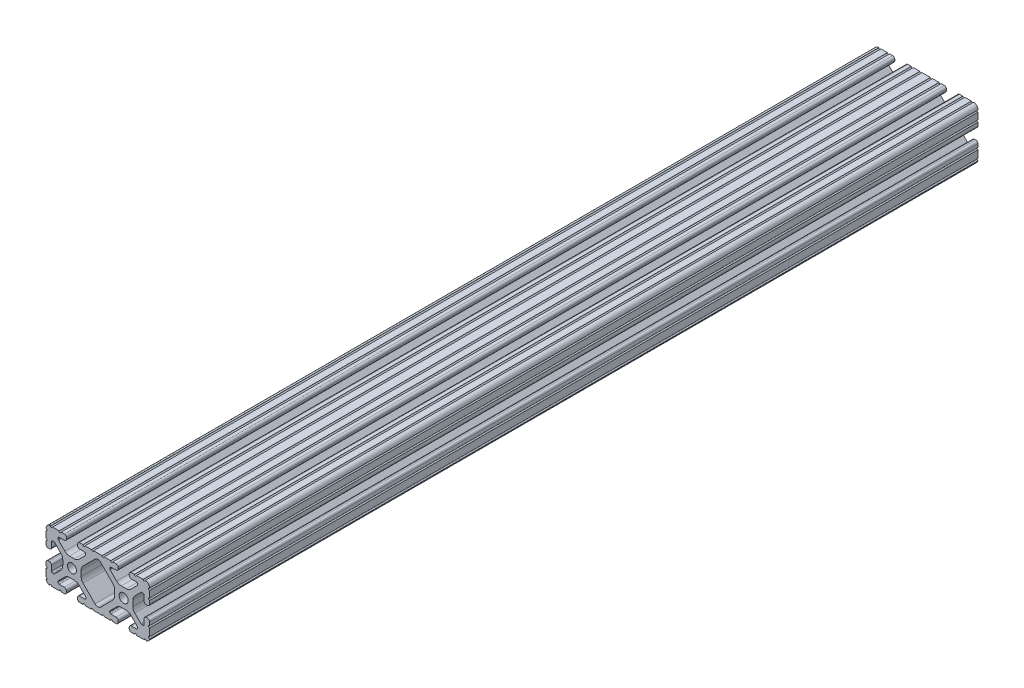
from build123d import *

# Parameters (mm, degrees)
SKETCH1_R      = 3.3274
EXTRUDE1_DEPTH = 609.6


with BuildPart() as part:
    # Sketch1 → Extrude1 (new body)
    with BuildSketch(Plane.XY):
        with BuildLine():
            Line((37.1900335, 54.320138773), (37.1900335, 54.882716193))
            ThreePointArc((37.1900335, 54.882716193), (37.450415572, 55.511334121), (38.0790335, 55.771716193))
            Line((38.0790335, 55.771716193), (41.685477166, 55.771716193))
            ThreePointArc((41.685477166, 55.771716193), (42.799028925, 56.232964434), (43.260277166, 57.346516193))
            Line((43.260277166, 57.346516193), (43.260277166, 58.282488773))
            ThreePointArc((43.260277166, 58.282488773), (42.805347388, 59.380786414), (41.707049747, 59.835716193))
            Line((41.707049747, 59.835716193), (39.271813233, 59.835716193))
            ThreePointArc((39.271813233, 59.835716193), (38.509813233, 59.073716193), (37.747813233, 59.835716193))
            Line((37.747813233, 59.835716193), (32.919398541, 59.835716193))
            ThreePointArc((32.919398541, 59.835716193), (32.157398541, 59.073716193), (31.395398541, 59.835716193))
            Line((31.395398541, 59.835716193), (25.153155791, 59.835716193))
            ThreePointArc((25.153155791, 59.835716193), (24.391155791, 59.073716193), (23.629155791, 59.835716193))
            Line((23.629155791, 59.835716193), (18.800741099, 59.835716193))
            ThreePointArc((18.800741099, 59.835716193), (18.038741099, 59.073716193), (17.276741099, 59.835716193))
            Line((17.276741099, 59.835716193), (14.841504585, 59.835716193))
            ThreePointArc((14.841504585, 59.835716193), (13.743206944, 59.380786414), (13.288277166, 58.282488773))
            Line((13.288277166, 58.282488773), (13.288277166, 57.346516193))
            ThreePointArc((13.288277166, 57.346516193), (13.749525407, 56.232964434), (14.863077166, 55.771716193))
            Line((14.863077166, 55.771716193), (18.469520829, 55.771716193))
            ThreePointArc((18.469520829, 55.771716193), (19.098138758, 55.511334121), (19.358520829, 54.882716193))
            Line((19.358520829, 54.882716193), (19.358520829, 54.320138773))
            ThreePointArc((19.358520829, 54.320138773), (19.290850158, 53.979934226), (19.098140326, 53.691522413))
            Line((19.098140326, 53.691522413), (14.421778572, 49.015137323))
            ThreePointArc((14.421778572, 49.015137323), (12.880829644, 47.985503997), (11.063154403, 47.623944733))
            Line((11.063154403, 47.623944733), (7.38539993, 47.623944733))
            ThreePointArc((7.38539993, 47.623944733), (5.567724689, 47.985503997), (4.026775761, 49.015137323))
            Line((4.026775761, 49.015137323), (-0.649585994, 53.691522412))
            ThreePointArc((-0.649585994, 53.691522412), (-0.842295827, 53.979934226), (-0.909966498, 54.320138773))
            Line((-0.909966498, 54.320138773), (-0.909966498, 54.882716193))
            ThreePointArc((-0.909966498, 54.882716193), (-0.649584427, 55.511334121), (-0.020966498, 55.771716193))
            Line((-0.020966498, 55.771716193), (3.585477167, 55.771716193))
            ThreePointArc((3.585477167, 55.771716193), (4.699028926, 56.232964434), (5.160277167, 57.346516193))
            Line((5.160277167, 57.346516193), (5.160277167, 58.266281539))
            ThreePointArc((5.160277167, 58.266281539), (4.744040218, 59.332924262), (3.715361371, 59.835716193))
            Line((3.715361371, 59.835716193), (1.328459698, 59.835716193))
            ThreePointArc((1.328459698, 59.835716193), (0.566459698, 59.073716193), (-0.195540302, 59.835716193))
            Line((-0.195540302, 59.835716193), (-5.021979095, 59.835716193))
            ThreePointArc((-5.021979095, 59.835716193), (-5.807035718, 59.097492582), (-6.545259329, 59.882549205))
            ThreePointArc((-6.545259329, 59.882549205), (-8.87374186, 58.977730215), (-9.863337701, 56.683993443))
            ThreePointArc((-9.863337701, 56.683993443), (-9.063955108, 55.941735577), (-9.825722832, 55.160922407))
            Line((-9.825722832, 55.160922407), (-9.825722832, 50.335417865))
            ThreePointArc((-9.825722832, 50.335417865), (-9.063722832, 49.573417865), (-9.825722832, 48.811417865))
            Line((-9.825722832, 48.811417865), (-9.825722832, 46.424516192))
            ThreePointArc((-9.825722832, 46.424516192), (-9.364474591, 45.310964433), (-8.250922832, 44.849716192))
            Line((-8.250922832, 44.849716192), (-7.336522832, 44.849716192))
            ThreePointArc((-7.336522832, 44.849716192), (-6.222971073, 45.310964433), (-5.761722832, 46.424516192))
            Line((-5.761722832, 46.424516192), (-5.761722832, 50.183716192))
            ThreePointArc((-5.761722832, 50.183716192), (-5.50134076, 50.81233412), (-4.872722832, 51.072716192))
            Line((-4.872722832, 51.072716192), (-4.146379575, 51.072716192))
            ThreePointArc((-4.146379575, 51.072716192), (-3.806172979, 51.005044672), (-3.517760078, 50.812332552))
            Line((-3.517760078, 50.812332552), (1.076701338, 46.217848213))
            ThreePointArc((1.076701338, 46.217848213), (2.10632244, 44.676905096), (2.467877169, 42.859240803))
            Line((2.467877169, 42.859240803), (2.467877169, 38.712191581))
            ThreePointArc((2.467877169, 38.712191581), (2.10632244, 36.894527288), (1.076701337, 35.353584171))
            Line((1.076701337, 35.353584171), (-3.517760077, 30.759099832))
            ThreePointArc((-3.517760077, 30.759099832), (-3.806172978, 30.566387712), (-4.146379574, 30.498716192))
            Line((-4.146379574, 30.498716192), (-4.872722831, 30.498716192))
            ThreePointArc((-4.872722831, 30.498716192), (-5.501340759, 30.759098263), (-5.761722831, 31.387716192))
            Line((-5.761722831, 31.387716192), (-5.761722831, 35.146916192))
            ThreePointArc((-5.761722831, 35.146916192), (-6.222971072, 36.260467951), (-7.336522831, 36.721716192))
            Line((-7.336522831, 36.721716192), (-8.250922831, 36.721716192))
            ThreePointArc((-8.250922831, 36.721716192), (-9.36447459, 36.260467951), (-9.825722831, 35.146916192))
            Line((-9.825722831, 35.146916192), (-9.825722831, 32.760014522))
            ThreePointArc((-9.825722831, 32.760014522), (-9.063722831, 31.998014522), (-9.825722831, 31.236014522))
            Line((-9.825722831, 31.236014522), (-9.825722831, 25.74969698))
            ThreePointArc((-9.825722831, 25.74969698), (-9.063722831, 24.98769698), (-9.825722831, 24.22569698))
            ThreePointArc((-9.825722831, 24.22569698), (-8.934545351, 22.601713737), (-7.296996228, 21.735716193))
            ThreePointArc((-7.296996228, 21.735716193), (-6.534996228, 22.497716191), (-5.77299623, 21.735716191))
            Line((-5.77299623, 21.735716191), (-0.195540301, 21.735716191))
            ThreePointArc((-0.195540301, 21.735716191), (0.566459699, 22.497716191), (1.328459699, 21.735716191))
            Line((1.328459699, 21.735716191), (3.585477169, 21.735716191))
            ThreePointArc((3.585477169, 21.735716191), (4.699028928, 22.196964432), (5.160277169, 23.310516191))
            Line((5.160277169, 23.310516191), (5.160277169, 24.224916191))
            ThreePointArc((5.160277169, 24.224916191), (4.699028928, 25.33846795), (3.585477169, 25.799716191))
            Line((3.585477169, 25.799716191), (-0.173722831, 25.799716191))
            ThreePointArc((-0.173722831, 25.799716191), (-0.80234076, 26.060098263), (-1.062722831, 26.688716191))
            Line((-1.062722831, 26.688716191), (-1.062722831, 27.098536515))
            ThreePointArc((-1.062722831, 27.098536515), (-0.99505216, 27.438741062), (-0.802342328, 27.727152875))
            Line((-0.802342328, 27.727152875), (4.026775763, 32.556295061))
            ThreePointArc((4.026775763, 32.556295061), (5.567724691, 33.585928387), (7.385399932, 33.947487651))
            Line((7.385399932, 33.947487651), (11.063154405, 33.947487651))
            ThreePointArc((11.063154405, 33.947487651), (12.880829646, 33.585928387), (14.421778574, 32.556295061))
            Line((14.421778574, 32.556295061), (19.250896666, 27.727152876))
            ThreePointArc((19.250896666, 27.727152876), (19.443606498, 27.438741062), (19.511277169, 27.098536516))
            Line((19.511277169, 27.098536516), (19.511277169, 26.688716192))
            ThreePointArc((19.511277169, 26.688716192), (19.250895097, 26.060098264), (18.622277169, 25.799716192))
            Line((18.622277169, 25.799716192), (14.863077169, 25.799716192))
            ThreePointArc((14.863077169, 25.799716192), (13.74952541, 25.338467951), (13.288277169, 24.224916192))
            Line((13.288277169, 24.224916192), (13.288277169, 23.310516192))
            ThreePointArc((13.288277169, 23.310516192), (13.74952541, 22.196964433), (14.863077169, 21.735716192))
            Line((14.863077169, 21.735716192), (17.276741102, 21.735716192))
            ThreePointArc((17.276741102, 21.735716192), (18.038741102, 22.497716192), (18.800741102, 21.735716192))
            Line((18.800741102, 21.735716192), (23.629155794, 21.735716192))
            ThreePointArc((23.629155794, 21.735716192), (24.391155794, 22.497716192), (25.153155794, 21.735716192))
            Line((25.153155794, 21.735716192), (31.395398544, 21.735716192))
            ThreePointArc((31.395398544, 21.735716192), (32.157398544, 22.497716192), (32.919398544, 21.735716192))
            Line((32.919398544, 21.735716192), (37.747813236, 21.735716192))
            ThreePointArc((37.747813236, 21.735716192), (38.509813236, 22.497716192), (39.271813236, 21.735716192))
            Line((39.271813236, 21.735716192), (41.685477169, 21.735716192))
            ThreePointArc((41.685477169, 21.735716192), (42.799028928, 22.196964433), (43.260277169, 23.310516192))
            Line((43.260277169, 23.310516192), (43.260277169, 24.224916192))
            ThreePointArc((43.260277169, 24.224916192), (42.799028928, 25.338467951), (41.685477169, 25.799716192))
            Line((41.685477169, 25.799716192), (37.926277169, 25.799716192))
            ThreePointArc((37.926277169, 25.799716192), (37.29765924, 26.060098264), (37.037277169, 26.688716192))
            Line((37.037277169, 26.688716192), (37.037277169, 27.098536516))
            ThreePointArc((37.037277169, 27.098536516), (37.10494784, 27.438741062), (37.297657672, 27.727152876))
            Line((37.297657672, 27.727152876), (42.126775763, 32.556295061))
            ThreePointArc((42.126775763, 32.556295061), (43.667724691, 33.585928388), (45.485399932, 33.947487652))
            Line((45.485399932, 33.947487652), (49.163154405, 33.947487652))
            ThreePointArc((49.163154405, 33.947487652), (50.980829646, 33.585928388), (52.521778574, 32.556295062))
            Line((52.521778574, 32.556295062), (57.350896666, 27.727152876))
            ThreePointArc((57.350896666, 27.727152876), (57.543606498, 27.438741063), (57.611277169, 27.098536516))
            Line((57.611277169, 27.098536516), (57.611277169, 26.688716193))
            ThreePointArc((57.611277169, 26.688716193), (57.350895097, 26.060098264), (56.722277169, 25.799716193))
            Line((56.722277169, 25.799716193), (52.963077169, 25.799716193))
            ThreePointArc((52.963077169, 25.799716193), (51.84952541, 25.338467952), (51.388277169, 24.224916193))
            Line((51.388277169, 24.224916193), (51.388277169, 23.310516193))
            ThreePointArc((51.388277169, 23.310516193), (51.84952541, 22.196964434), (52.963077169, 21.735716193))
            Line((52.963077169, 21.735716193), (55.220094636, 21.735716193))
            ThreePointArc((55.220094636, 21.735716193), (55.982094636, 22.497716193), (56.744094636, 21.735716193))
            Line((56.744094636, 21.735716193), (62.321550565, 21.735716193))
            ThreePointArc((62.321550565, 21.735716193), (63.083550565, 22.497716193), (63.845550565, 21.735716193))
            ThreePointArc((63.845550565, 21.735716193), (65.481854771, 22.602978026), (66.374277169, 24.225696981))
            ThreePointArc((66.374277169, 24.225696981), (65.612277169, 24.987696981), (66.374277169, 25.749696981))
            Line((66.374277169, 25.749696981), (66.374277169, 31.236014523))
            ThreePointArc((66.374277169, 31.236014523), (65.612277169, 31.998014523), (66.374277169, 32.760014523))
            Line((66.374277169, 32.760014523), (66.374277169, 35.146916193))
            ThreePointArc((66.374277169, 35.146916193), (65.913028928, 36.260467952), (64.799477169, 36.721716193))
            Line((64.799477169, 36.721716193), (63.885077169, 36.721716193))
            ThreePointArc((63.885077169, 36.721716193), (62.77152541, 36.260467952), (62.310277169, 35.146916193))
            Line((62.310277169, 35.146916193), (62.310277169, 31.387716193))
            ThreePointArc((62.310277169, 31.387716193), (62.049895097, 30.759098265), (61.421277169, 30.498716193))
            Line((61.421277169, 30.498716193), (60.694933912, 30.498716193))
            ThreePointArc((60.694933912, 30.498716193), (60.354727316, 30.566387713), (60.066314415, 30.759099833))
            Line((60.066314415, 30.759099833), (55.471853, 35.353584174))
            ThreePointArc((55.471853, 35.353584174), (54.442231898, 36.894527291), (54.08067717, 38.712191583))
            Line((54.08067717, 38.712191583), (54.08067717, 42.859240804))
            ThreePointArc((54.08067717, 42.859240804), (54.442231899, 44.676905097), (55.471853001, 46.217848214))
            Line((55.471853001, 46.217848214), (60.066314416, 50.812332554))
            ThreePointArc((60.066314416, 50.812332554), (60.354727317, 51.005044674), (60.694933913, 51.072716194))
            Line((60.694933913, 51.072716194), (61.42127717, 51.072716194))
            ThreePointArc((61.42127717, 51.072716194), (62.049895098, 50.812334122), (62.31027717, 50.183716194))
            Line((62.31027717, 50.183716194), (62.31027717, 46.424516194))
            ThreePointArc((62.31027717, 46.424516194), (62.771525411, 45.310964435), (63.88507717, 44.849716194))
            Line((63.88507717, 44.849716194), (64.79947717, 44.849716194))
            ThreePointArc((64.79947717, 44.849716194), (65.913028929, 45.310964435), (66.37427717, 46.424516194))
            Line((66.37427717, 46.424516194), (66.37427717, 48.811417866))
            ThreePointArc((66.37427717, 48.811417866), (65.61227717, 49.573417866), (66.37427717, 50.335417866))
            Line((66.37427717, 50.335417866), (66.37427717, 55.160922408))
            ThreePointArc((66.37427717, 55.160922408), (65.612509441, 55.941735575), (66.411892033, 56.683993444))
            ThreePointArc((66.411892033, 56.683993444), (65.422296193, 58.977730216), (63.093813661, 59.882549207))
            ThreePointArc((63.093813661, 59.882549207), (62.355590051, 59.097492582), (61.570533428, 59.835716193))
            Line((61.570533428, 59.835716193), (56.744094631, 59.835716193))
            ThreePointArc((56.744094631, 59.835716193), (55.982094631, 59.073716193), (55.220094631, 59.835716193))
            Line((55.220094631, 59.835716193), (52.833192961, 59.835716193))
            ThreePointArc((52.833192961, 59.835716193), (51.804514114, 59.332924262), (51.388277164, 58.266281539))
            Line((51.388277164, 58.266281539), (51.388277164, 57.346516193))
            ThreePointArc((51.388277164, 57.346516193), (51.849525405, 56.232964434), (52.963077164, 55.771716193))
            Line((52.963077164, 55.771716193), (56.569520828, 55.771716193))
            ThreePointArc((56.569520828, 55.771716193), (57.198138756, 55.511334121), (57.458520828, 54.882716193))
            Line((57.458520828, 54.882716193), (57.458520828, 54.320138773))
            ThreePointArc((57.458520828, 54.320138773), (57.390850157, 53.979934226), (57.198140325, 53.691522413))
            Line((57.198140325, 53.691522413), (52.52177857, 49.015137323))
            ThreePointArc((52.52177857, 49.015137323), (50.980829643, 47.985503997), (49.163154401, 47.623944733))
            Line((49.163154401, 47.623944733), (45.485399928, 47.623944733))
            ThreePointArc((45.485399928, 47.623944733), (43.667724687, 47.985503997), (42.12677576, 49.015137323))
            Line((42.12677576, 49.015137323), (37.450414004, 53.691522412))
            ThreePointArc((37.450414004, 53.691522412), (37.257704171, 53.979934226), (37.1900335, 54.320138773))
        make_face()
        with Locations(Location((47.324277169, 40.785716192, 0), (0, 0, 180))):
            Circle(SKETCH1_R, mode=Mode.SUBTRACT)
        with Locations(Location((9.224277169, 40.785716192, 0), (0, 0, 180))):
            Circle(SKETCH1_R, mode=Mode.SUBTRACT)
        with BuildLine():
            Line((30.35131253, 26.52815133), (39.176701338, 35.353584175))
            ThreePointArc((39.176701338, 35.353584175), (40.206322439, 36.894527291), (40.567877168, 38.712191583))
            Line((40.567877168, 38.712191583), (40.567877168, 42.859240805))
            ThreePointArc((40.567877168, 42.859240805), (40.206322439, 44.676905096), (39.176701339, 46.217848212))
            Line((39.176701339, 46.217848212), (30.35131253, 55.043281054))
            ThreePointArc((30.35131253, 55.043281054), (29.39832277, 55.678689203), (28.274277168, 55.898812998))
            ThreePointArc((28.274277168, 55.898812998), (27.150231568, 55.678689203), (26.197241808, 55.043281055))
            Line((26.197241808, 55.043281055), (17.371853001, 46.217848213))
            ThreePointArc((17.371853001, 46.217848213), (16.342231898, 44.676905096), (15.980677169, 42.859240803))
            Line((15.980677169, 42.859240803), (15.980677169, 38.712191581))
            ThreePointArc((15.980677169, 38.712191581), (16.342231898, 36.894527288), (17.371853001, 35.353584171))
            Line((17.371853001, 35.353584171), (26.197241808, 26.528151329))
            ThreePointArc((26.197241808, 26.528151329), (27.150231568, 25.892743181), (28.274277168, 25.672619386))
            ThreePointArc((28.274277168, 25.672619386), (29.39832277, 25.892743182), (30.35131253, 26.52815133))
        make_face(mode=Mode.SUBTRACT)
    extrude(amount=EXTRUDE1_DEPTH)


solid = part.part
